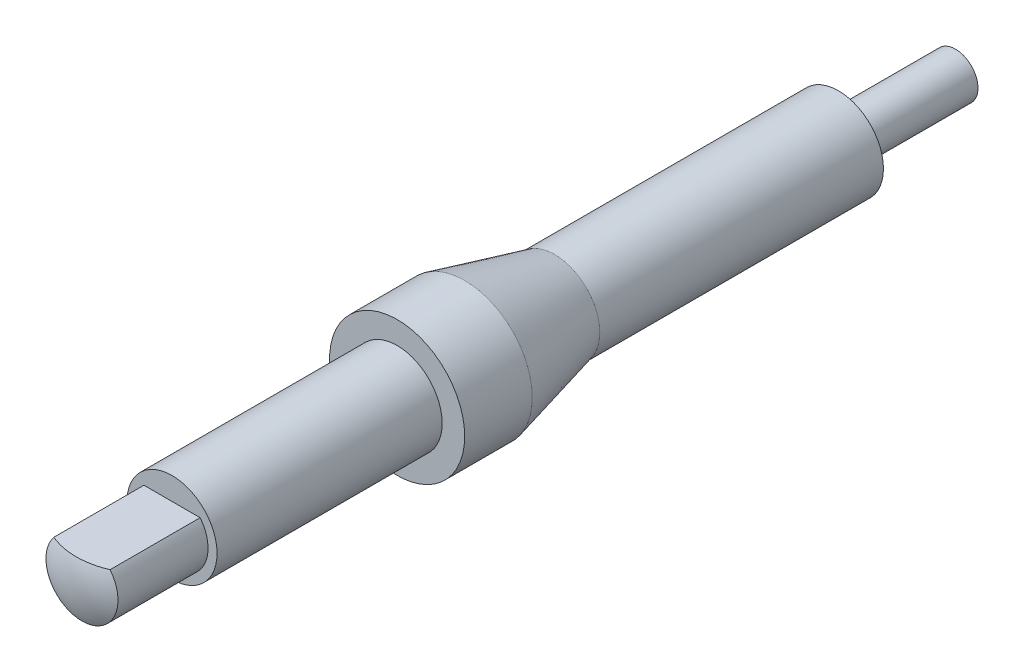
ISO-10303-21;
HEADER;
FILE_DESCRIPTION(('STEP AP214'),'2;1');
FILE_NAME('part.step','',(''),(''),'','','');
FILE_SCHEMA(('AUTOMOTIVE_DESIGN { 1 0 10303 214 1 1 1 1 }'));
ENDSEC;
DATA;
#1=APPLICATION_CONTEXT('core data for automotive mechanical design processes');
#2=APPLICATION_PROTOCOL_DEFINITION('international standard','automotive_design',2000,#1);
#3=PRODUCT_CONTEXT('',#1,'mechanical');
#4=PRODUCT('Part','Part','',(#3));
#5=PRODUCT_RELATED_PRODUCT_CATEGORY('part','',(#4));
#6=PRODUCT_DEFINITION_FORMATION('','',#4);
#7=PRODUCT_DEFINITION_CONTEXT('part definition',#1,'design');
#8=PRODUCT_DEFINITION('design','',#6,#7);
#9=PRODUCT_DEFINITION_SHAPE('','',#8);
#10=(LENGTH_UNIT() NAMED_UNIT(*) SI_UNIT(.MILLI.,.METRE.));
#11=(NAMED_UNIT(*) PLANE_ANGLE_UNIT() SI_UNIT($,.RADIAN.));
#12=(NAMED_UNIT(*) SI_UNIT($,.STERADIAN.) SOLID_ANGLE_UNIT());
#13=UNCERTAINTY_MEASURE_WITH_UNIT(LENGTH_MEASURE(1.E-05),#10,'distance_accuracy_value','');
#14=(GEOMETRIC_REPRESENTATION_CONTEXT(3) GLOBAL_UNCERTAINTY_ASSIGNED_CONTEXT((#13)) GLOBAL_UNIT_ASSIGNED_CONTEXT((#10,
#11,#12)) REPRESENTATION_CONTEXT('',''));
#15=CARTESIAN_POINT('',(0.,0.,0.));
#16=DIRECTION('',(0.,0.,1.));
#17=DIRECTION('',(1.,0.,0.));
#18=AXIS2_PLACEMENT_3D('',#15,#16,#17);
#19=CARTESIAN_POINT('',(0.,0.,-14.5213471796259));
#20=DIRECTION('',(0.,0.,1.));
#21=DIRECTION('',(0.,1.,0.));
#22=AXIS2_PLACEMENT_3D('',#19,#20,#21);
#23=SPHERICAL_SURFACE('',#22,16.57918948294);
#24=CARTESIAN_POINT('',(0.,5.,-14.5213471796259));
#25=DIRECTION('',(0.,1.,0.));
#26=DIRECTION('',(0.,0.,1.));
#27=AXIS2_PLACEMENT_3D('',#24,#25,#26);
#28=CIRCLE('',#27,15.8072617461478);
#29=CARTESIAN_POINT('',(-6.2449979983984,5.,0.));
#30=VERTEX_POINT('',#29);
#31=CARTESIAN_POINT('',(6.2449979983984,5.,0.));
#32=VERTEX_POINT('',#31);
#33=EDGE_CURVE('E57',#30,#32,#28,.T.);
#34=ORIENTED_EDGE('',*,*,#33,.F.);
#35=CARTESIAN_POINT('',(0.,0.,0.));
#36=DIRECTION('',(0.,0.,1.));
#37=DIRECTION('',(1.,0.,0.));
#38=AXIS2_PLACEMENT_3D('',#35,#36,#37);
#39=CIRCLE('',#38,8.);
#40=EDGE_CURVE('E64',#30,#32,#39,.T.);
#41=ORIENTED_EDGE('',*,*,#40,.T.);
#42=EDGE_LOOP('',(#34,#41));
#43=FACE_BOUND('',#42,.T.);
#44=ADVANCED_FACE('F31',(#43),#23,.T.);
#45=CARTESIAN_POINT('',(0.,0.,2.05784230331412));
#46=DIRECTION('',(0.,0.,1.));
#47=DIRECTION('',(1.,0.,0.));
#48=AXIS2_PLACEMENT_3D('',#45,#46,#47);
#49=CYLINDRICAL_SURFACE('',#48,8.);
#50=DIRECTION('',(0.,0.,1.));
#51=VECTOR('',#50,1.);
#52=CARTESIAN_POINT('',(-6.2449979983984,5.,2.05784230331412));
#53=LINE('',#52,#51);
#54=CARTESIAN_POINT('',(-6.2449979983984,5.,-20.));
#55=VERTEX_POINT('',#54);
#56=EDGE_CURVE('E11',#55,#30,#53,.T.);
#57=ORIENTED_EDGE('',*,*,#56,.F.);
#58=CARTESIAN_POINT('',(0.,0.,-20.));
#59=DIRECTION('',(0.,0.,1.));
#60=DIRECTION('',(1.,0.,0.));
#61=AXIS2_PLACEMENT_3D('',#58,#59,#60);
#62=CIRCLE('',#61,8.);
#63=CARTESIAN_POINT('',(6.2449979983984,5.,-20.));
#64=VERTEX_POINT('',#63);
#65=EDGE_CURVE('E62',#55,#64,#62,.T.);
#66=ORIENTED_EDGE('',*,*,#65,.T.);
#67=DIRECTION('',(0.,0.,1.));
#68=VECTOR('',#67,1.);
#69=CARTESIAN_POINT('',(6.2449979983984,5.,2.05784230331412));
#70=LINE('',#69,#68);
#71=EDGE_CURVE('E38',#32,#64,#70,.F.);
#72=ORIENTED_EDGE('',*,*,#71,.F.);
#73=ORIENTED_EDGE('',*,*,#40,.F.);
#74=EDGE_LOOP('',(#57,#66,#72,#73));
#75=FACE_BOUND('',#74,.T.);
#76=ADVANCED_FACE('F61',(#75),#49,.T.);
#77=CARTESIAN_POINT('',(0.,0.,-184.66631749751));
#78=DIRECTION('',(0.,0.,1.));
#79=DIRECTION('',(0.,1.,0.));
#80=AXIS2_PLACEMENT_3D('',#77,#78,#79);
#81=SPHERICAL_SURFACE('',#80,10.5885612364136);
#82=CARTESIAN_POINT('',(0.,0.,-194.));
#83=DIRECTION('',(0.,0.,1.));
#84=DIRECTION('',(1.,0.,0.));
#85=AXIS2_PLACEMENT_3D('',#82,#83,#84);
#86=CIRCLE('',#85,5.);
#87=CARTESIAN_POINT('',(5.,0.,-194.));
#88=VERTEX_POINT('',#87);
#89=EDGE_CURVE('E92',#88,#88,#86,.T.);
#90=ORIENTED_EDGE('',*,*,#89,.F.);
#91=EDGE_LOOP('',(#90));
#92=FACE_BOUND('',#91,.T.);
#93=ADVANCED_FACE('F98',(#92),#81,.T.);
#94=CARTESIAN_POINT('',(0.,0.,2.05784230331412));
#95=DIRECTION('',(0.,0.,1.));
#96=DIRECTION('',(1.,0.,0.));
#97=AXIS2_PLACEMENT_3D('',#94,#95,#96);
#98=CYLINDRICAL_SURFACE('',#97,5.);
#99=CARTESIAN_POINT('',(0.,0.,-168.));
#100=DIRECTION('',(0.,0.,1.));
#101=DIRECTION('',(1.,0.,0.));
#102=AXIS2_PLACEMENT_3D('',#99,#100,#101);
#103=CIRCLE('',#102,5.);
#104=CARTESIAN_POINT('',(5.,0.,-168.));
#105=VERTEX_POINT('',#104);
#106=EDGE_CURVE('E89',#105,#105,#103,.T.);
#107=ORIENTED_EDGE('',*,*,#106,.F.);
#108=EDGE_LOOP('',(#107));
#109=FACE_BOUND('',#108,.T.);
#110=ORIENTED_EDGE('',*,*,#89,.T.);
#111=EDGE_LOOP('',(#110));
#112=FACE_BOUND('',#111,.T.);
#113=ADVANCED_FACE('F96',(#109,#112),#98,.T.);
#114=CARTESIAN_POINT('',(0.,10.,-168.));
#115=DIRECTION('',(0.,0.,1.));
#116=DIRECTION('',(1.,0.,0.));
#117=AXIS2_PLACEMENT_3D('',#114,#115,#116);
#118=PLANE('',#117);
#119=CARTESIAN_POINT('',(0.,0.,-168.));
#120=DIRECTION('',(0.,0.,1.));
#121=DIRECTION('',(1.,0.,0.));
#122=AXIS2_PLACEMENT_3D('',#119,#120,#121);
#123=CIRCLE('',#122,10.);
#124=CARTESIAN_POINT('',(10.,0.,-168.));
#125=VERTEX_POINT('',#124);
#126=EDGE_CURVE('E86',#125,#125,#123,.T.);
#127=ORIENTED_EDGE('',*,*,#126,.F.);
#128=EDGE_LOOP('',(#127));
#129=FACE_BOUND('',#128,.T.);
#130=ORIENTED_EDGE('',*,*,#106,.T.);
#131=EDGE_LOOP('',(#130));
#132=FACE_BOUND('',#131,.T.);
#133=ADVANCED_FACE('F104',(#129,#132),#118,.F.);
#134=CARTESIAN_POINT('',(0.,0.,2.05784230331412));
#135=DIRECTION('',(0.,0.,1.));
#136=DIRECTION('',(1.,0.,0.));
#137=AXIS2_PLACEMENT_3D('',#134,#135,#136);
#138=CYLINDRICAL_SURFACE('',#137,10.);
#139=CARTESIAN_POINT('',(0.,0.,-105.));
#140=DIRECTION('',(0.,0.,1.));
#141=DIRECTION('',(1.,0.,0.));
#142=AXIS2_PLACEMENT_3D('',#139,#140,#141);
#143=CIRCLE('',#142,10.);
#144=CARTESIAN_POINT('',(10.,0.,-105.));
#145=VERTEX_POINT('',#144);
#146=EDGE_CURVE('E83',#145,#145,#143,.T.);
#147=ORIENTED_EDGE('',*,*,#146,.F.);
#148=EDGE_LOOP('',(#147));
#149=FACE_BOUND('',#148,.T.);
#150=ORIENTED_EDGE('',*,*,#126,.T.);
#151=EDGE_LOOP('',(#150));
#152=FACE_BOUND('',#151,.T.);
#153=ADVANCED_FACE('F161',(#149,#152),#138,.T.);
#154=CARTESIAN_POINT('',(0.,0.,-105.));
#155=DIRECTION('',(0.,0.,1.));
#156=DIRECTION('',(1.,0.,0.));
#157=AXIS2_PLACEMENT_3D('',#154,#155,#156);
#158=CONICAL_SURFACE('',#157,10.,0.244978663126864);
#159=CARTESIAN_POINT('',(0.,0.,-85.));
#160=DIRECTION('',(0.,0.,1.));
#161=DIRECTION('',(1.,0.,0.));
#162=AXIS2_PLACEMENT_3D('',#159,#160,#161);
#163=CIRCLE('',#162,15.);
#164=CARTESIAN_POINT('',(15.,0.,-85.));
#165=VERTEX_POINT('',#164);
#166=EDGE_CURVE('E80',#165,#165,#163,.T.);
#167=ORIENTED_EDGE('',*,*,#166,.F.);
#168=EDGE_LOOP('',(#167));
#169=FACE_BOUND('',#168,.T.);
#170=ORIENTED_EDGE('',*,*,#146,.T.);
#171=EDGE_LOOP('',(#170));
#172=FACE_BOUND('',#171,.T.);
#173=ADVANCED_FACE('F157',(#169,#172),#158,.T.);
#174=CARTESIAN_POINT('',(0.,0.,2.05784230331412));
#175=DIRECTION('',(0.,0.,1.));
#176=DIRECTION('',(1.,0.,0.));
#177=AXIS2_PLACEMENT_3D('',#174,#175,#176);
#178=CYLINDRICAL_SURFACE('',#177,15.);
#179=CARTESIAN_POINT('',(0.,0.,-70.));
#180=DIRECTION('',(0.,0.,1.));
#181=DIRECTION('',(1.,0.,0.));
#182=AXIS2_PLACEMENT_3D('',#179,#180,#181);
#183=CIRCLE('',#182,15.);
#184=CARTESIAN_POINT('',(15.,0.,-70.));
#185=VERTEX_POINT('',#184);
#186=EDGE_CURVE('E77',#185,#185,#183,.T.);
#187=ORIENTED_EDGE('',*,*,#186,.F.);
#188=EDGE_LOOP('',(#187));
#189=FACE_BOUND('',#188,.T.);
#190=ORIENTED_EDGE('',*,*,#166,.T.);
#191=EDGE_LOOP('',(#190));
#192=FACE_BOUND('',#191,.T.);
#193=ADVANCED_FACE('F153',(#189,#192),#178,.T.);
#194=CARTESIAN_POINT('',(0.,10.,-70.));
#195=DIRECTION('',(0.,0.,-1.));
#196=DIRECTION('',(-1.,0.,0.));
#197=AXIS2_PLACEMENT_3D('',#194,#195,#196);
#198=PLANE('',#197);
#199=CARTESIAN_POINT('',(0.,0.,-70.));
#200=DIRECTION('',(0.,0.,1.));
#201=DIRECTION('',(1.,0.,0.));
#202=AXIS2_PLACEMENT_3D('',#199,#200,#201);
#203=CIRCLE('',#202,10.);
#204=CARTESIAN_POINT('',(10.,0.,-70.));
#205=VERTEX_POINT('',#204);
#206=EDGE_CURVE('E70',#205,#205,#203,.T.);
#207=ORIENTED_EDGE('',*,*,#206,.F.);
#208=EDGE_LOOP('',(#207));
#209=FACE_BOUND('',#208,.T.);
#210=ORIENTED_EDGE('',*,*,#186,.T.);
#211=EDGE_LOOP('',(#210));
#212=FACE_BOUND('',#211,.T.);
#213=ADVANCED_FACE('F128',(#209,#212),#198,.F.);
#214=CARTESIAN_POINT('',(0.,0.,2.05784230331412));
#215=DIRECTION('',(0.,0.,1.));
#216=DIRECTION('',(1.,0.,0.));
#217=AXIS2_PLACEMENT_3D('',#214,#215,#216);
#218=CYLINDRICAL_SURFACE('',#217,10.);
#219=CARTESIAN_POINT('',(0.,0.,-20.));
#220=DIRECTION('',(0.,0.,1.));
#221=DIRECTION('',(1.,0.,0.));
#222=AXIS2_PLACEMENT_3D('',#219,#220,#221);
#223=CIRCLE('',#222,10.);
#224=CARTESIAN_POINT('',(10.,0.,-20.));
#225=VERTEX_POINT('',#224);
#226=EDGE_CURVE('E67',#225,#225,#223,.T.);
#227=ORIENTED_EDGE('',*,*,#226,.F.);
#228=EDGE_LOOP('',(#227));
#229=FACE_BOUND('',#228,.T.);
#230=ORIENTED_EDGE('',*,*,#206,.T.);
#231=EDGE_LOOP('',(#230));
#232=FACE_BOUND('',#231,.T.);
#233=ADVANCED_FACE('F123',(#229,#232),#218,.T.);
#234=CARTESIAN_POINT('',(0.,8.,-20.));
#235=DIRECTION('',(0.,0.,-1.));
#236=DIRECTION('',(-1.,0.,0.));
#237=AXIS2_PLACEMENT_3D('',#234,#235,#236);
#238=PLANE('',#237);
#239=ORIENTED_EDGE('',*,*,#65,.F.);
#240=DIRECTION('',(1.,0.,0.));
#241=VECTOR('',#240,1.);
#242=CARTESIAN_POINT('',(-10.,5.,-20.));
#243=LINE('',#242,#241);
#244=EDGE_CURVE('E44',#55,#64,#243,.T.);
#245=ORIENTED_EDGE('',*,*,#244,.T.);
#246=EDGE_LOOP('',(#239,#245));
#247=FACE_BOUND('',#246,.T.);
#248=ORIENTED_EDGE('',*,*,#226,.T.);
#249=EDGE_LOOP('',(#248));
#250=FACE_BOUND('',#249,.T.);
#251=ADVANCED_FACE('F65',(#247,#250),#238,.F.);
#252=CARTESIAN_POINT('',(-10.,5.,2.));
#253=DIRECTION('',(0.,1.,0.));
#254=DIRECTION('',(0.,0.,1.));
#255=AXIS2_PLACEMENT_3D('',#252,#253,#254);
#256=PLANE('',#255);
#257=ORIENTED_EDGE('',*,*,#56,.T.);
#258=ORIENTED_EDGE('',*,*,#33,.T.);
#259=ORIENTED_EDGE('',*,*,#71,.T.);
#260=ORIENTED_EDGE('',*,*,#244,.F.);
#261=EDGE_LOOP('',(#257,#258,#259,#260));
#262=FACE_BOUND('',#261,.T.);
#263=ADVANCED_FACE('F54',(#262),#256,.T.);
#264=CLOSED_SHELL('',(#44,#76,#93,#113,#133,#153,#173,#193,#213,#233,#251,#263));
#265=MANIFOLD_SOLID_BREP('B2',#264);
#266=ADVANCED_BREP_SHAPE_REPRESENTATION('',(#18,#265),#14);
#267=SHAPE_DEFINITION_REPRESENTATION(#9,#266);
ENDSEC;
END-ISO-10303-21;
